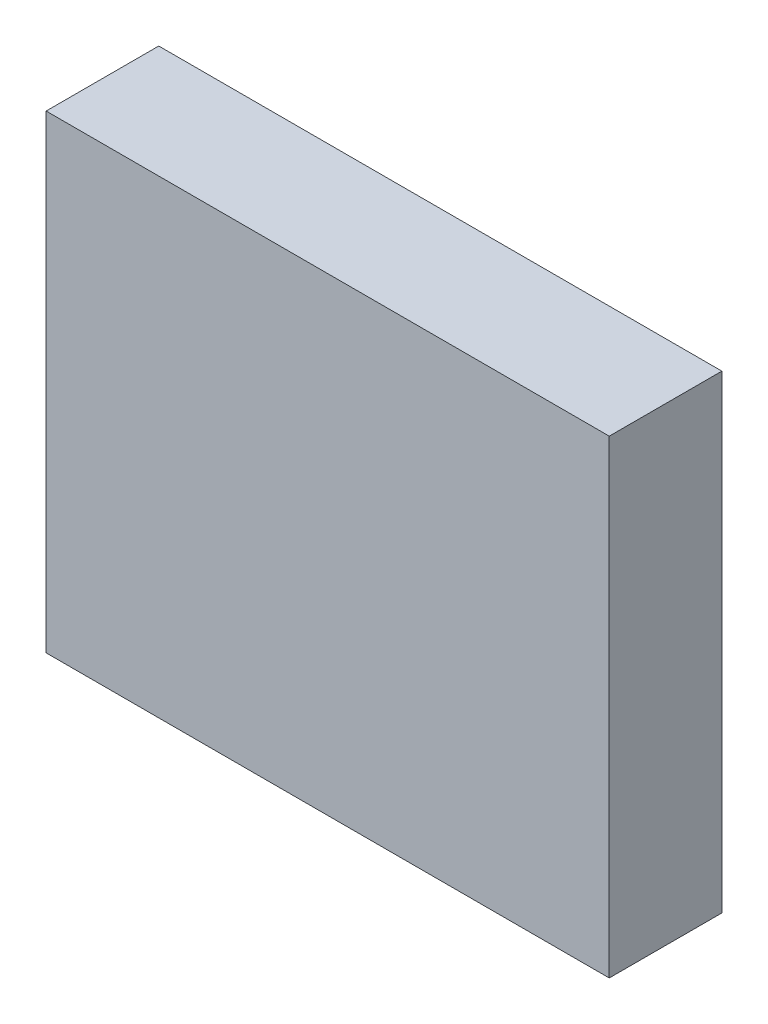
from build123d import *

# Parameters (mm, degrees)
SKETCH_1_W      = 60
SKETCH_1_H      = 50
EXTRUDE_1_DEPTH = 12


with BuildPart() as part:
    # Sketch 1 → Extrude 1 (new body)
    with BuildSketch(Plane.XY):
        with Locations((30, 25)):
            Rectangle(SKETCH_1_W, SKETCH_1_H)
    extrude(amount=EXTRUDE_1_DEPTH)


solid = part.part
